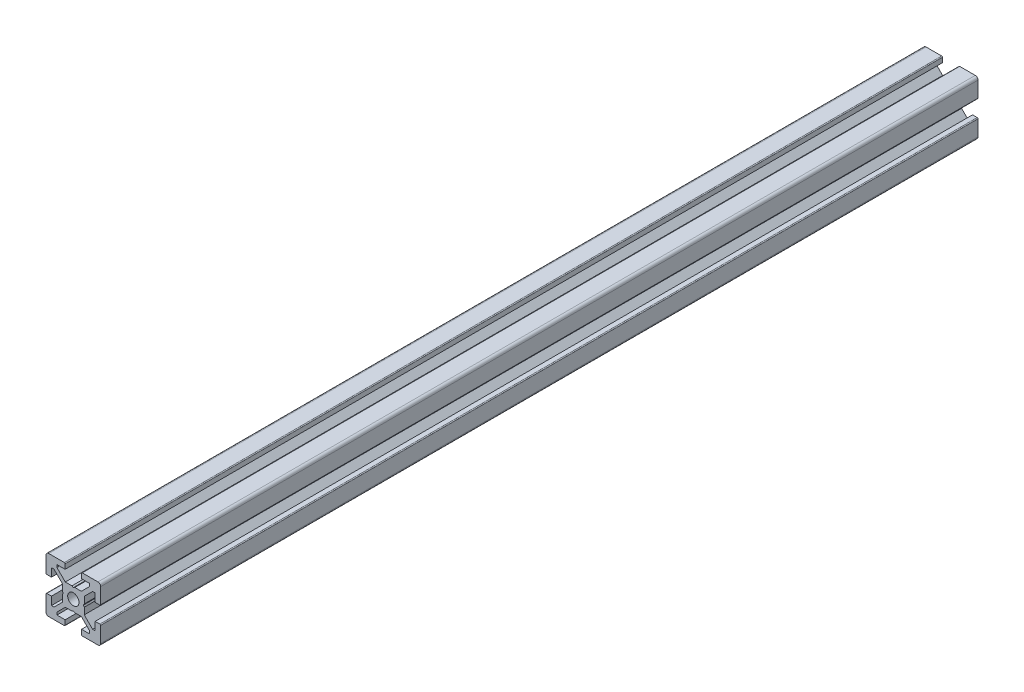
from build123d import *

# Parameters (mm, degrees)
BOSS_EXTRUDE1_DEPTH = 321
SKETCH2_W           = 321
SKETCH2_H           = 2.067


with BuildPart() as part:
    # Sketch1 → Boss-Extrude1 (new body)
    with BuildSketch(Plane.XY):
        with BuildLine():
            Line((-10, 9), (-10, 3.29999995))
            ThreePointArc((-10, 3.29999995), (-9.912132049, 3.087867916), (-9.7, 3))
            Line((-9.7, 3), (-8, 3))
            Line((-8, 3), (-8, 6))
            Line((-8, 6), (-7.060677, 6))
            Line((-7.060677, 6), (-4, 2.93932965))
            Line((-4, 2.93932965), (-4, 0.519615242))
            Line((-4, 0.519615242), (-3.699996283, -6.437e-06))
            Line((-3.699996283, -6.437e-06), (-4, -0.519628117))
            Line((-4, -0.519628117), (-4, -2.93933725))
            Line((-4, -2.93933725), (-7.0606695, -6))
            Line((-7.0606695, -6), (-8, -6))
            Line((-8, -6), (-8, -3))
            Line((-8, -3), (-9.7, -3))
            ThreePointArc((-9.7, -3), (-9.912132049, -3.087867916), (-10, -3.29999995))
            Line((-10, -3.29999995), (-10, -9))
            ThreePointArc((-10, -9), (-9.707106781, -9.707106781), (-9, -10))
            Line((-9, -10), (-3.29999995, -10))
            ThreePointArc((-3.29999995, -10), (-3.087867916, -9.912132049), (-3, -9.7))
            Line((-3, -9.7), (-3, -8))
            Line((-3, -8), (-6, -8))
            Line((-6, -8), (-6, -7.0606515))
            Line((-6, -7.0606515), (-2.9393489, -4))
            Line((-2.9393489, -4), (-0.519615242, -4))
            Line((-0.519615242, -4), (6.437e-06, -3.699996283))
            Line((6.437e-06, -3.699996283), (0.519628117, -4))
            Line((0.519628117, -4), (2.9393227, -4))
            Line((2.9393227, -4), (6, -7.060677))
            Line((6, -7.060677), (6, -8))
            Line((6, -8), (3, -8))
            Line((3, -8), (3, -9.7))
            ThreePointArc((3, -9.7), (3.087867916, -9.912132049), (3.29999995, -10))
            Line((3.29999995, -10), (9, -10))
            ThreePointArc((9, -10), (9.707106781, -9.707106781), (10, -9))
            Line((10, -9), (10, -3.29999995))
            ThreePointArc((10, -3.29999995), (9.912132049, -3.087867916), (9.7, -3))
            Line((9.7, -3), (8, -3))
            Line((8, -3), (8, -6))
            Line((8, -6), (7.0606435, -6))
            Line((7.0606435, -6), (4, -2.9393482))
            Line((4, -2.9393482), (4, -0.519615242))
            Line((4, -0.519615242), (3.699996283, 6.437e-06))
            Line((3.699996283, 6.437e-06), (4, 0.519628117))
            Line((4, 0.519628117), (4, 2.9393401))
            Line((4, 2.9393401), (7.060651, 6))
            Line((7.060651, 6), (8, 6))
            Line((8, 6), (8, 3))
            Line((8, 3), (9.7, 3))
            ThreePointArc((9.7, 3), (9.912132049, 3.087867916), (10, 3.29999995))
            Line((10, 3.29999995), (10, 9))
            ThreePointArc((10, 9), (9.707106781, 9.707106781), (9, 10))
            Line((9, 10), (3.29999995, 10))
            ThreePointArc((3.29999995, 10), (3.087867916, 9.912132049), (3, 9.7))
            Line((3, 9.7), (3, 8))
            Line((3, 8), (6, 8))
            Line((6, 8), (6, 7.060669))
            Line((6, 7.060669), (2.9393308, 4))
            Line((2.9393308, 4), (0.519615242, 4))
            Line((0.519615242, 4), (-6.437e-06, 3.699996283))
            Line((-6.437e-06, 3.699996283), (-0.519628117, 4))
            Line((-0.519628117, 4), (-2.93935655, 4))
            Line((-2.93935655, 4), (-6, 7.0606435))
            Line((-6, 7.0606435), (-6, 8))
            Line((-6, 8), (-3, 8))
            Line((-3, 8), (-3, 9.7))
            ThreePointArc((-3, 9.7), (-3.087867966, 9.912132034), (-3.3, 10))
            Line((-3.3, 10), (-9, 10))
            ThreePointArc((-9, 10), (-9.707106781, 9.707106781), (-10, 9))
        make_face()
    extrude(amount=-BOSS_EXTRUDE1_DEPTH)

    # Sketch2 → Cut-Revolve1 (revolve, cut)
    with BuildSketch(Plane(origin=(0, 0, 0), x_dir=(0, 0, -1), z_dir=(1, 0, 0)), mode=Mode.PRIVATE) as cut_revolve1_sk:
        with Locations((160.5, 1.0335)):
            Rectangle(SKETCH2_W, SKETCH2_H)
    revolve(cut_revolve1_sk.sketch.rotate(Axis((0, 0, -321), (0, 0, 1)), 180), axis=Axis((0, 0, -321), (0, 0, 1)), mode=Mode.SUBTRACT)


solid = part.part
